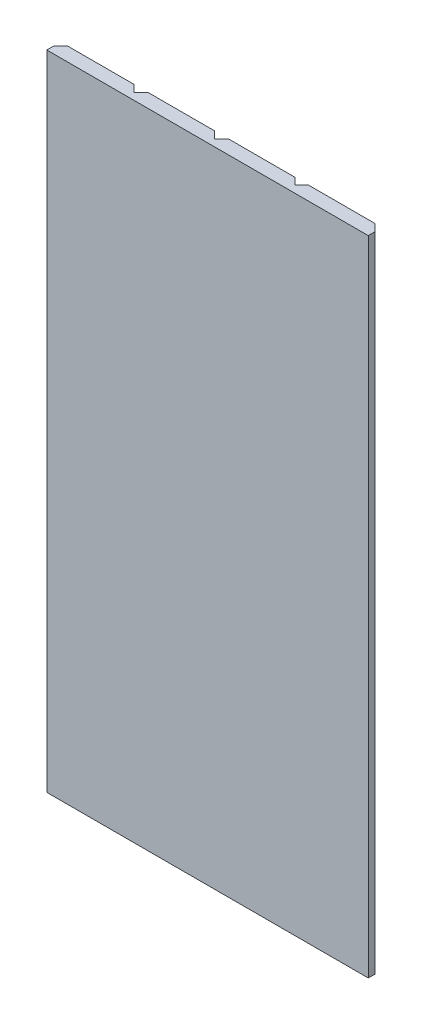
ISO-10303-21;
HEADER;
FILE_DESCRIPTION(('STEP AP214'),'2;1');
FILE_NAME('part.step','',(''),(''),'','','');
FILE_SCHEMA(('AUTOMOTIVE_DESIGN { 1 0 10303 214 1 1 1 1 }'));
ENDSEC;
DATA;
#1=APPLICATION_CONTEXT('core data for automotive mechanical design processes');
#2=APPLICATION_PROTOCOL_DEFINITION('international standard','automotive_design',2000,#1);
#3=PRODUCT_CONTEXT('',#1,'mechanical');
#4=PRODUCT('Part','Part','',(#3));
#5=PRODUCT_RELATED_PRODUCT_CATEGORY('part','',(#4));
#6=PRODUCT_DEFINITION_FORMATION('','',#4);
#7=PRODUCT_DEFINITION_CONTEXT('part definition',#1,'design');
#8=PRODUCT_DEFINITION('design','',#6,#7);
#9=PRODUCT_DEFINITION_SHAPE('','',#8);
#10=(LENGTH_UNIT() NAMED_UNIT(*) SI_UNIT(.MILLI.,.METRE.));
#11=(NAMED_UNIT(*) PLANE_ANGLE_UNIT() SI_UNIT($,.RADIAN.));
#12=(NAMED_UNIT(*) SI_UNIT($,.STERADIAN.) SOLID_ANGLE_UNIT());
#13=UNCERTAINTY_MEASURE_WITH_UNIT(LENGTH_MEASURE(1.E-05),#10,'distance_accuracy_value','');
#14=(GEOMETRIC_REPRESENTATION_CONTEXT(3) GLOBAL_UNCERTAINTY_ASSIGNED_CONTEXT((#13)) GLOBAL_UNIT_ASSIGNED_CONTEXT((#10,
#11,#12)) REPRESENTATION_CONTEXT('',''));
#15=CARTESIAN_POINT('',(0.,0.,0.));
#16=DIRECTION('',(0.,0.,1.));
#17=DIRECTION('',(1.,0.,0.));
#18=AXIS2_PLACEMENT_3D('',#15,#16,#17);
#19=CARTESIAN_POINT('',(-290.,-580.,25.));
#20=DIRECTION('',(0.,1.,0.));
#21=DIRECTION('',(0.,0.,1.));
#22=AXIS2_PLACEMENT_3D('',#19,#20,#21);
#23=PLANE('',#22);
#24=DIRECTION('',(0.70710678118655,0.,0.707106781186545));
#25=VECTOR('',#24,1.);
#26=CARTESIAN_POINT('',(290.,-580.,12.5000000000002));
#27=LINE('',#26,#25);
#28=CARTESIAN_POINT('',(277.5,-580.,0.));
#29=VERTEX_POINT('',#28);
#30=CARTESIAN_POINT('',(290.,-580.,12.5000000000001));
#31=VERTEX_POINT('',#30);
#32=EDGE_CURVE('E47',#29,#31,#27,.T.);
#33=ORIENTED_EDGE('',*,*,#32,.T.);
#34=DIRECTION('',(0.,0.,-1.));
#35=VECTOR('',#34,1.);
#36=CARTESIAN_POINT('',(290.,-580.,25.));
#37=LINE('',#36,#35);
#38=CARTESIAN_POINT('',(290.,-580.,25.));
#39=VERTEX_POINT('',#38);
#40=EDGE_CURVE('E154',#39,#31,#37,.T.);
#41=ORIENTED_EDGE('',*,*,#40,.F.);
#42=DIRECTION('',(1.,0.,0.));
#43=VECTOR('',#42,1.);
#44=CARTESIAN_POINT('',(-290.,-580.,25.));
#45=LINE('',#44,#43);
#46=CARTESIAN_POINT('',(-290.,-580.,25.));
#47=VERTEX_POINT('',#46);
#48=EDGE_CURVE('E244',#47,#39,#45,.T.);
#49=ORIENTED_EDGE('',*,*,#48,.F.);
#50=DIRECTION('',(0.,0.,-1.));
#51=VECTOR('',#50,1.);
#52=CARTESIAN_POINT('',(-290.,-580.,25.));
#53=LINE('',#52,#51);
#54=CARTESIAN_POINT('',(-290.,-580.,12.5000000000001));
#55=VERTEX_POINT('',#54);
#56=EDGE_CURVE('E161',#47,#55,#53,.T.);
#57=ORIENTED_EDGE('',*,*,#56,.T.);
#58=DIRECTION('',(-0.70710678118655,0.,0.707106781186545));
#59=VECTOR('',#58,1.);
#60=CARTESIAN_POINT('',(-290.,-580.,12.5000000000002));
#61=LINE('',#60,#59);
#62=CARTESIAN_POINT('',(-277.5,-580.,0.));
#63=VERTEX_POINT('',#62);
#64=EDGE_CURVE('E235',#63,#55,#61,.T.);
#65=ORIENTED_EDGE('',*,*,#64,.F.);
#66=DIRECTION('',(1.,0.,0.));
#67=VECTOR('',#66,1.);
#68=CARTESIAN_POINT('',(-290.,-580.,0.));
#69=LINE('',#68,#67);
#70=CARTESIAN_POINT('',(-157.5,-580.,0.));
#71=VERTEX_POINT('',#70);
#72=EDGE_CURVE('E249',#63,#71,#69,.T.);
#73=ORIENTED_EDGE('',*,*,#72,.T.);
#74=DIRECTION('',(0.70710678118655,0.,0.707106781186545));
#75=VECTOR('',#74,1.);
#76=CARTESIAN_POINT('',(-145.,-580.,12.5000000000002));
#77=LINE('',#76,#75);
#78=CARTESIAN_POINT('',(-145.,-580.,12.5000000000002));
#79=VERTEX_POINT('',#78);
#80=EDGE_CURVE('E222',#71,#79,#77,.T.);
#81=ORIENTED_EDGE('',*,*,#80,.T.);
#82=DIRECTION('',(-0.70710678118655,0.,0.707106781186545));
#83=VECTOR('',#82,1.);
#84=CARTESIAN_POINT('',(-145.,-580.,12.5000000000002));
#85=LINE('',#84,#83);
#86=CARTESIAN_POINT('',(-132.5,-580.,0.));
#87=VERTEX_POINT('',#86);
#88=EDGE_CURVE('E225',#87,#79,#85,.T.);
#89=ORIENTED_EDGE('',*,*,#88,.F.);
#90=CARTESIAN_POINT('',(-12.5000000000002,-580.,0.));
#91=VERTEX_POINT('',#90);
#92=EDGE_CURVE('E252',#87,#91,#69,.T.);
#93=ORIENTED_EDGE('',*,*,#92,.T.);
#94=DIRECTION('',(0.70710678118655,0.,0.707106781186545));
#95=VECTOR('',#94,1.);
#96=CARTESIAN_POINT('',(0.,-580.,12.5000000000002));
#97=LINE('',#96,#95);
#98=CARTESIAN_POINT('',(0.,-580.,12.5000000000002));
#99=VERTEX_POINT('',#98);
#100=EDGE_CURVE('E212',#91,#99,#97,.T.);
#101=ORIENTED_EDGE('',*,*,#100,.T.);
#102=DIRECTION('',(-0.70710678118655,0.,0.707106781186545));
#103=VECTOR('',#102,1.);
#104=CARTESIAN_POINT('',(0.,-580.,12.5000000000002));
#105=LINE('',#104,#103);
#106=CARTESIAN_POINT('',(12.5000000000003,-580.,0.));
#107=VERTEX_POINT('',#106);
#108=EDGE_CURVE('E215',#107,#99,#105,.T.);
#109=ORIENTED_EDGE('',*,*,#108,.F.);
#110=CARTESIAN_POINT('',(132.5,-580.,0.));
#111=VERTEX_POINT('',#110);
#112=EDGE_CURVE('E271',#107,#111,#69,.T.);
#113=ORIENTED_EDGE('',*,*,#112,.T.);
#114=DIRECTION('',(0.70710678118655,0.,0.707106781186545));
#115=VECTOR('',#114,1.);
#116=CARTESIAN_POINT('',(145.,-580.,12.5000000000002));
#117=LINE('',#116,#115);
#118=CARTESIAN_POINT('',(145.,-580.,12.5000000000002));
#119=VERTEX_POINT('',#118);
#120=EDGE_CURVE('E55',#111,#119,#117,.T.);
#121=ORIENTED_EDGE('',*,*,#120,.T.);
#122=DIRECTION('',(-0.70710678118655,0.,0.707106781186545));
#123=VECTOR('',#122,1.);
#124=CARTESIAN_POINT('',(145.,-580.,12.5000000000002));
#125=LINE('',#124,#123);
#126=CARTESIAN_POINT('',(157.5,-580.,0.));
#127=VERTEX_POINT('',#126);
#128=EDGE_CURVE('E194',#127,#119,#125,.T.);
#129=ORIENTED_EDGE('',*,*,#128,.F.);
#130=EDGE_CURVE('E189',#127,#29,#69,.T.);
#131=ORIENTED_EDGE('',*,*,#130,.T.);
#132=EDGE_LOOP('',(#33,#41,#49,#57,#65,#73,#81,#89,#93,#101,#109,#113,#121,#129,#131));
#133=FACE_BOUND('',#132,.T.);
#134=ADVANCED_FACE('F33',(#133),#23,.F.);
#135=CARTESIAN_POINT('',(290.,580.,25.));
#136=DIRECTION('',(-1.,0.,0.));
#137=DIRECTION('',(0.,0.,1.));
#138=AXIS2_PLACEMENT_3D('',#135,#136,#137);
#139=PLANE('',#138);
#140=DIRECTION('',(0.,1.,0.));
#141=VECTOR('',#140,1.);
#142=CARTESIAN_POINT('',(290.,-651.151247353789,12.5000000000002));
#143=LINE('',#142,#141);
#144=CARTESIAN_POINT('',(290.,580.,12.5000000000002));
#145=VERTEX_POINT('',#144);
#146=EDGE_CURVE('E141',#31,#145,#143,.T.);
#147=ORIENTED_EDGE('',*,*,#146,.T.);
#148=DIRECTION('',(0.,0.,-1.));
#149=VECTOR('',#148,1.);
#150=CARTESIAN_POINT('',(290.,580.,25.));
#151=LINE('',#150,#149);
#152=CARTESIAN_POINT('',(290.,580.,25.));
#153=VERTEX_POINT('',#152);
#154=EDGE_CURVE('E151',#153,#145,#151,.T.);
#155=ORIENTED_EDGE('',*,*,#154,.F.);
#156=DIRECTION('',(0.,1.,0.));
#157=VECTOR('',#156,1.);
#158=CARTESIAN_POINT('',(290.,580.,25.));
#159=LINE('',#158,#157);
#160=EDGE_CURVE('E246',#39,#153,#159,.T.);
#161=ORIENTED_EDGE('',*,*,#160,.F.);
#162=ORIENTED_EDGE('',*,*,#40,.T.);
#163=EDGE_LOOP('',(#147,#155,#161,#162));
#164=FACE_BOUND('',#163,.T.);
#165=ADVANCED_FACE('F149',(#164),#139,.F.);
#166=CARTESIAN_POINT('',(-290.,580.,25.));
#167=DIRECTION('',(0.,-1.,0.));
#168=DIRECTION('',(0.,0.,-1.));
#169=AXIS2_PLACEMENT_3D('',#166,#167,#168);
#170=PLANE('',#169);
#171=DIRECTION('',(-0.70710678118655,0.,-0.707106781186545));
#172=VECTOR('',#171,1.);
#173=CARTESIAN_POINT('',(290.,580.,12.5000000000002));
#174=LINE('',#173,#172);
#175=CARTESIAN_POINT('',(277.5,580.,0.));
#176=VERTEX_POINT('',#175);
#177=EDGE_CURVE('E138',#145,#176,#174,.T.);
#178=ORIENTED_EDGE('',*,*,#177,.T.);
#179=DIRECTION('',(-1.,0.,0.));
#180=VECTOR('',#179,1.);
#181=CARTESIAN_POINT('',(-290.,580.,0.));
#182=LINE('',#181,#180);
#183=CARTESIAN_POINT('',(157.5,580.,0.));
#184=VERTEX_POINT('',#183);
#185=EDGE_CURVE('E187',#176,#184,#182,.T.);
#186=ORIENTED_EDGE('',*,*,#185,.T.);
#187=DIRECTION('',(0.70710678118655,0.,-0.707106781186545));
#188=VECTOR('',#187,1.);
#189=CARTESIAN_POINT('',(145.,580.,12.5000000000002));
#190=LINE('',#189,#188);
#191=CARTESIAN_POINT('',(145.,580.,12.5000000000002));
#192=VERTEX_POINT('',#191);
#193=EDGE_CURVE('E196',#192,#184,#190,.T.);
#194=ORIENTED_EDGE('',*,*,#193,.F.);
#195=DIRECTION('',(-0.70710678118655,0.,-0.707106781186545));
#196=VECTOR('',#195,1.);
#197=CARTESIAN_POINT('',(145.,580.,12.5000000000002));
#198=LINE('',#197,#196);
#199=CARTESIAN_POINT('',(132.5,580.,0.));
#200=VERTEX_POINT('',#199);
#201=EDGE_CURVE('E208',#192,#200,#198,.T.);
#202=ORIENTED_EDGE('',*,*,#201,.T.);
#203=CARTESIAN_POINT('',(12.5000000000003,580.,0.));
#204=VERTEX_POINT('',#203);
#205=EDGE_CURVE('E253',#200,#204,#182,.T.);
#206=ORIENTED_EDGE('',*,*,#205,.T.);
#207=DIRECTION('',(0.70710678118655,0.,-0.707106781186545));
#208=VECTOR('',#207,1.);
#209=CARTESIAN_POINT('',(0.,580.,12.5000000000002));
#210=LINE('',#209,#208);
#211=CARTESIAN_POINT('',(0.,580.,12.5000000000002));
#212=VERTEX_POINT('',#211);
#213=EDGE_CURVE('E199',#212,#204,#210,.T.);
#214=ORIENTED_EDGE('',*,*,#213,.F.);
#215=DIRECTION('',(-0.70710678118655,0.,-0.707106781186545));
#216=VECTOR('',#215,1.);
#217=CARTESIAN_POINT('',(0.,580.,12.5000000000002));
#218=LINE('',#217,#216);
#219=CARTESIAN_POINT('',(-12.5000000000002,580.,0.));
#220=VERTEX_POINT('',#219);
#221=EDGE_CURVE('E202',#212,#220,#218,.T.);
#222=ORIENTED_EDGE('',*,*,#221,.T.);
#223=CARTESIAN_POINT('',(-132.5,580.,0.));
#224=VERTEX_POINT('',#223);
#225=EDGE_CURVE('E254',#220,#224,#182,.T.);
#226=ORIENTED_EDGE('',*,*,#225,.T.);
#227=DIRECTION('',(0.70710678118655,0.,-0.707106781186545));
#228=VECTOR('',#227,1.);
#229=CARTESIAN_POINT('',(-145.,580.,12.5000000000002));
#230=LINE('',#229,#228);
#231=CARTESIAN_POINT('',(-145.,580.,12.5000000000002));
#232=VERTEX_POINT('',#231);
#233=EDGE_CURVE('E217',#232,#224,#230,.T.);
#234=ORIENTED_EDGE('',*,*,#233,.F.);
#235=DIRECTION('',(-0.70710678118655,0.,-0.707106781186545));
#236=VECTOR('',#235,1.);
#237=CARTESIAN_POINT('',(-145.,580.,12.5000000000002));
#238=LINE('',#237,#236);
#239=CARTESIAN_POINT('',(-157.5,580.,0.));
#240=VERTEX_POINT('',#239);
#241=EDGE_CURVE('E231',#232,#240,#238,.T.);
#242=ORIENTED_EDGE('',*,*,#241,.T.);
#243=CARTESIAN_POINT('',(-277.5,580.,0.));
#244=VERTEX_POINT('',#243);
#245=EDGE_CURVE('E251',#240,#244,#182,.T.);
#246=ORIENTED_EDGE('',*,*,#245,.T.);
#247=DIRECTION('',(0.70710678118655,0.,-0.707106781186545));
#248=VECTOR('',#247,1.);
#249=CARTESIAN_POINT('',(-290.,580.,12.5000000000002));
#250=LINE('',#249,#248);
#251=CARTESIAN_POINT('',(-290.,580.,12.5000000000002));
#252=VERTEX_POINT('',#251);
#253=EDGE_CURVE('E228',#252,#244,#250,.T.);
#254=ORIENTED_EDGE('',*,*,#253,.F.);
#255=DIRECTION('',(0.,0.,-1.));
#256=VECTOR('',#255,1.);
#257=CARTESIAN_POINT('',(-290.,580.,25.));
#258=LINE('',#257,#256);
#259=CARTESIAN_POINT('',(-290.,580.,25.));
#260=VERTEX_POINT('',#259);
#261=EDGE_CURVE('E159',#260,#252,#258,.T.);
#262=ORIENTED_EDGE('',*,*,#261,.F.);
#263=DIRECTION('',(-1.,0.,0.));
#264=VECTOR('',#263,1.);
#265=CARTESIAN_POINT('',(-290.,580.,25.));
#266=LINE('',#265,#264);
#267=EDGE_CURVE('E158',#153,#260,#266,.T.);
#268=ORIENTED_EDGE('',*,*,#267,.F.);
#269=ORIENTED_EDGE('',*,*,#154,.T.);
#270=EDGE_LOOP('',(#178,#186,#194,#202,#206,#214,#222,#226,#234,#242,#246,#254,#262,#268,#269));
#271=FACE_BOUND('',#270,.T.);
#272=ADVANCED_FACE('F156',(#271),#170,.F.);
#273=CARTESIAN_POINT('',(0.,0.,0.));
#274=DIRECTION('',(0.,0.,1.));
#275=DIRECTION('',(1.,0.,0.));
#276=AXIS2_PLACEMENT_3D('',#273,#274,#275);
#277=PLANE('',#276);
#278=DIRECTION('',(0.,1.,0.));
#279=VECTOR('',#278,1.);
#280=CARTESIAN_POINT('',(277.5,0.,0.));
#281=LINE('',#280,#279);
#282=EDGE_CURVE('E11',#29,#176,#281,.T.);
#283=ORIENTED_EDGE('',*,*,#282,.F.);
#284=ORIENTED_EDGE('',*,*,#130,.F.);
#285=DIRECTION('',(0.,1.,0.));
#286=VECTOR('',#285,1.);
#287=CARTESIAN_POINT('',(157.5,0.,0.));
#288=LINE('',#287,#286);
#289=EDGE_CURVE('E41',#127,#184,#288,.T.);
#290=ORIENTED_EDGE('',*,*,#289,.T.);
#291=ORIENTED_EDGE('',*,*,#185,.F.);
#292=EDGE_LOOP('',(#283,#284,#290,#291));
#293=FACE_BOUND('',#292,.T.);
#294=ADVANCED_FACE('F186',(#293),#277,.F.);
#295=DIRECTION('',(0.,1.,0.));
#296=VECTOR('',#295,1.);
#297=CARTESIAN_POINT('',(132.5,0.,0.));
#298=LINE('',#297,#296);
#299=EDGE_CURVE('E182',#111,#200,#298,.T.);
#300=ORIENTED_EDGE('',*,*,#299,.F.);
#301=ORIENTED_EDGE('',*,*,#112,.F.);
#302=DIRECTION('',(0.,1.,0.));
#303=VECTOR('',#302,1.);
#304=CARTESIAN_POINT('',(12.5000000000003,0.,0.));
#305=LINE('',#304,#303);
#306=EDGE_CURVE('E179',#107,#204,#305,.T.);
#307=ORIENTED_EDGE('',*,*,#306,.T.);
#308=ORIENTED_EDGE('',*,*,#205,.F.);
#309=EDGE_LOOP('',(#300,#301,#307,#308));
#310=FACE_BOUND('',#309,.T.);
#311=ADVANCED_FACE('F275',(#310),#277,.F.);
#312=DIRECTION('',(0.,1.,0.));
#313=VECTOR('',#312,1.);
#314=CARTESIAN_POINT('',(-12.5000000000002,0.,0.));
#315=LINE('',#314,#313);
#316=EDGE_CURVE('E177',#91,#220,#315,.T.);
#317=ORIENTED_EDGE('',*,*,#316,.F.);
#318=ORIENTED_EDGE('',*,*,#92,.F.);
#319=DIRECTION('',(0.,1.,0.));
#320=VECTOR('',#319,1.);
#321=CARTESIAN_POINT('',(-132.5,0.,0.));
#322=LINE('',#321,#320);
#323=EDGE_CURVE('E174',#87,#224,#322,.T.);
#324=ORIENTED_EDGE('',*,*,#323,.T.);
#325=ORIENTED_EDGE('',*,*,#225,.F.);
#326=EDGE_LOOP('',(#317,#318,#324,#325));
#327=FACE_BOUND('',#326,.T.);
#328=ADVANCED_FACE('F269',(#327),#277,.F.);
#329=DIRECTION('',(0.,1.,0.));
#330=VECTOR('',#329,1.);
#331=CARTESIAN_POINT('',(-157.5,0.,0.));
#332=LINE('',#331,#330);
#333=EDGE_CURVE('E172',#71,#240,#332,.T.);
#334=ORIENTED_EDGE('',*,*,#333,.F.);
#335=ORIENTED_EDGE('',*,*,#72,.F.);
#336=DIRECTION('',(0.,1.,0.));
#337=VECTOR('',#336,1.);
#338=CARTESIAN_POINT('',(-277.5,0.,0.));
#339=LINE('',#338,#337);
#340=EDGE_CURVE('E169',#63,#244,#339,.T.);
#341=ORIENTED_EDGE('',*,*,#340,.T.);
#342=ORIENTED_EDGE('',*,*,#245,.F.);
#343=EDGE_LOOP('',(#334,#335,#341,#342));
#344=FACE_BOUND('',#343,.T.);
#345=ADVANCED_FACE('F303',(#344),#277,.F.);
#346=CARTESIAN_POINT('',(-290.,580.,25.));
#347=DIRECTION('',(1.,0.,0.));
#348=DIRECTION('',(0.,0.,-1.));
#349=AXIS2_PLACEMENT_3D('',#346,#347,#348);
#350=PLANE('',#349);
#351=DIRECTION('',(0.,1.,0.));
#352=VECTOR('',#351,1.);
#353=CARTESIAN_POINT('',(-290.,-651.151247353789,12.5000000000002));
#354=LINE('',#353,#352);
#355=EDGE_CURVE('E237',#55,#252,#354,.T.);
#356=ORIENTED_EDGE('',*,*,#355,.F.);
#357=ORIENTED_EDGE('',*,*,#56,.F.);
#358=DIRECTION('',(0.,-1.,0.));
#359=VECTOR('',#358,1.);
#360=CARTESIAN_POINT('',(-290.,580.,25.));
#361=LINE('',#360,#359);
#362=EDGE_CURVE('E241',#260,#47,#361,.T.);
#363=ORIENTED_EDGE('',*,*,#362,.F.);
#364=ORIENTED_EDGE('',*,*,#261,.T.);
#365=EDGE_LOOP('',(#356,#357,#363,#364));
#366=FACE_BOUND('',#365,.T.);
#367=ADVANCED_FACE('F35',(#366),#350,.F.);
#368=CARTESIAN_POINT('',(0.,0.,25.));
#369=DIRECTION('',(0.,0.,1.));
#370=DIRECTION('',(1.,0.,0.));
#371=AXIS2_PLACEMENT_3D('',#368,#369,#370);
#372=PLANE('',#371);
#373=ORIENTED_EDGE('',*,*,#362,.T.);
#374=ORIENTED_EDGE('',*,*,#48,.T.);
#375=ORIENTED_EDGE('',*,*,#160,.T.);
#376=ORIENTED_EDGE('',*,*,#267,.T.);
#377=EDGE_LOOP('',(#373,#374,#375,#376));
#378=FACE_BOUND('',#377,.T.);
#379=ADVANCED_FACE('F304',(#378),#372,.T.);
#380=CARTESIAN_POINT('',(-290.,-651.151247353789,12.5000000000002));
#381=DIRECTION('',(0.707106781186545,0.,0.70710678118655));
#382=DIRECTION('',(0.70710678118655,0.,-0.707106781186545));
#383=AXIS2_PLACEMENT_3D('',#380,#381,#382);
#384=PLANE('',#383);
#385=ORIENTED_EDGE('',*,*,#64,.T.);
#386=ORIENTED_EDGE('',*,*,#355,.T.);
#387=ORIENTED_EDGE('',*,*,#253,.T.);
#388=ORIENTED_EDGE('',*,*,#340,.F.);
#389=EDGE_LOOP('',(#385,#386,#387,#388));
#390=FACE_BOUND('',#389,.T.);
#391=ADVANCED_FACE('F307',(#390),#384,.F.);
#392=CARTESIAN_POINT('',(-145.,-651.151247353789,12.5000000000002));
#393=DIRECTION('',(0.707106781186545,0.,0.70710678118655));
#394=DIRECTION('',(0.70710678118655,0.,-0.707106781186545));
#395=AXIS2_PLACEMENT_3D('',#392,#393,#394);
#396=PLANE('',#395);
#397=ORIENTED_EDGE('',*,*,#88,.T.);
#398=DIRECTION('',(0.,1.,0.));
#399=VECTOR('',#398,1.);
#400=CARTESIAN_POINT('',(-145.,-651.151247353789,12.5000000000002));
#401=LINE('',#400,#399);
#402=EDGE_CURVE('E226',#79,#232,#401,.T.);
#403=ORIENTED_EDGE('',*,*,#402,.T.);
#404=ORIENTED_EDGE('',*,*,#233,.T.);
#405=ORIENTED_EDGE('',*,*,#323,.F.);
#406=EDGE_LOOP('',(#397,#403,#404,#405));
#407=FACE_BOUND('',#406,.T.);
#408=ADVANCED_FACE('F264',(#407),#396,.F.);
#409=CARTESIAN_POINT('',(-145.,-651.151247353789,12.5000000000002));
#410=DIRECTION('',(0.707106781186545,0.,-0.70710678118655));
#411=DIRECTION('',(-0.70710678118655,0.,-0.707106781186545));
#412=AXIS2_PLACEMENT_3D('',#409,#410,#411);
#413=PLANE('',#412);
#414=ORIENTED_EDGE('',*,*,#333,.T.);
#415=ORIENTED_EDGE('',*,*,#241,.F.);
#416=ORIENTED_EDGE('',*,*,#402,.F.);
#417=ORIENTED_EDGE('',*,*,#80,.F.);
#418=EDGE_LOOP('',(#414,#415,#416,#417));
#419=FACE_BOUND('',#418,.T.);
#420=ADVANCED_FACE('F291',(#419),#413,.T.);
#421=CARTESIAN_POINT('',(0.,-651.151247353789,12.5000000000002));
#422=DIRECTION('',(0.707106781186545,0.,0.70710678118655));
#423=DIRECTION('',(0.70710678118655,0.,-0.707106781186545));
#424=AXIS2_PLACEMENT_3D('',#421,#422,#423);
#425=PLANE('',#424);
#426=ORIENTED_EDGE('',*,*,#108,.T.);
#427=DIRECTION('',(0.,1.,0.));
#428=VECTOR('',#427,1.);
#429=CARTESIAN_POINT('',(0.,-651.151247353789,12.5000000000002));
#430=LINE('',#429,#428);
#431=EDGE_CURVE('E216',#99,#212,#430,.T.);
#432=ORIENTED_EDGE('',*,*,#431,.T.);
#433=ORIENTED_EDGE('',*,*,#213,.T.);
#434=ORIENTED_EDGE('',*,*,#306,.F.);
#435=EDGE_LOOP('',(#426,#432,#433,#434));
#436=FACE_BOUND('',#435,.T.);
#437=ADVANCED_FACE('F280',(#436),#425,.F.);
#438=CARTESIAN_POINT('',(0.,-651.151247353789,12.5000000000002));
#439=DIRECTION('',(0.707106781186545,0.,-0.70710678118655));
#440=DIRECTION('',(-0.70710678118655,0.,-0.707106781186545));
#441=AXIS2_PLACEMENT_3D('',#438,#439,#440);
#442=PLANE('',#441);
#443=ORIENTED_EDGE('',*,*,#316,.T.);
#444=ORIENTED_EDGE('',*,*,#221,.F.);
#445=ORIENTED_EDGE('',*,*,#431,.F.);
#446=ORIENTED_EDGE('',*,*,#100,.F.);
#447=EDGE_LOOP('',(#443,#444,#445,#446));
#448=FACE_BOUND('',#447,.T.);
#449=ADVANCED_FACE('F283',(#448),#442,.T.);
#450=CARTESIAN_POINT('',(145.,-651.151247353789,12.5000000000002));
#451=DIRECTION('',(0.707106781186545,0.,0.70710678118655));
#452=DIRECTION('',(0.70710678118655,0.,-0.707106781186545));
#453=AXIS2_PLACEMENT_3D('',#450,#451,#452);
#454=PLANE('',#453);
#455=ORIENTED_EDGE('',*,*,#128,.T.);
#456=DIRECTION('',(0.,1.,0.));
#457=VECTOR('',#456,1.);
#458=CARTESIAN_POINT('',(145.,-651.151247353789,12.5000000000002));
#459=LINE('',#458,#457);
#460=EDGE_CURVE('E204',#119,#192,#459,.T.);
#461=ORIENTED_EDGE('',*,*,#460,.T.);
#462=ORIENTED_EDGE('',*,*,#193,.T.);
#463=ORIENTED_EDGE('',*,*,#289,.F.);
#464=EDGE_LOOP('',(#455,#461,#462,#463));
#465=FACE_BOUND('',#464,.T.);
#466=ADVANCED_FACE('F193',(#465),#454,.F.);
#467=CARTESIAN_POINT('',(145.,-651.151247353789,12.5000000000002));
#468=DIRECTION('',(0.707106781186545,0.,-0.70710678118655));
#469=DIRECTION('',(-0.70710678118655,0.,-0.707106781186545));
#470=AXIS2_PLACEMENT_3D('',#467,#468,#469);
#471=PLANE('',#470);
#472=ORIENTED_EDGE('',*,*,#299,.T.);
#473=ORIENTED_EDGE('',*,*,#201,.F.);
#474=ORIENTED_EDGE('',*,*,#460,.F.);
#475=ORIENTED_EDGE('',*,*,#120,.F.);
#476=EDGE_LOOP('',(#472,#473,#474,#475));
#477=FACE_BOUND('',#476,.T.);
#478=ADVANCED_FACE('F278',(#477),#471,.T.);
#479=CARTESIAN_POINT('',(290.,-651.151247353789,12.5000000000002));
#480=DIRECTION('',(0.707106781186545,0.,-0.70710678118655));
#481=DIRECTION('',(-0.70710678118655,0.,-0.707106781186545));
#482=AXIS2_PLACEMENT_3D('',#479,#480,#481);
#483=PLANE('',#482);
#484=ORIENTED_EDGE('',*,*,#282,.T.);
#485=ORIENTED_EDGE('',*,*,#177,.F.);
#486=ORIENTED_EDGE('',*,*,#146,.F.);
#487=ORIENTED_EDGE('',*,*,#32,.F.);
#488=EDGE_LOOP('',(#484,#485,#486,#487));
#489=FACE_BOUND('',#488,.T.);
#490=ADVANCED_FACE('F140',(#489),#483,.T.);
#491=CLOSED_SHELL('',(#134,#165,#272,#294,#311,#328,#345,#367,#379,#391,#408,#420,#437,#449,
#466,#478,#490));
#492=MANIFOLD_SOLID_BREP('B2',#491);
#493=ADVANCED_BREP_SHAPE_REPRESENTATION('',(#18,#492),#14);
#494=SHAPE_DEFINITION_REPRESENTATION(#9,#493);
ENDSEC;
END-ISO-10303-21;
